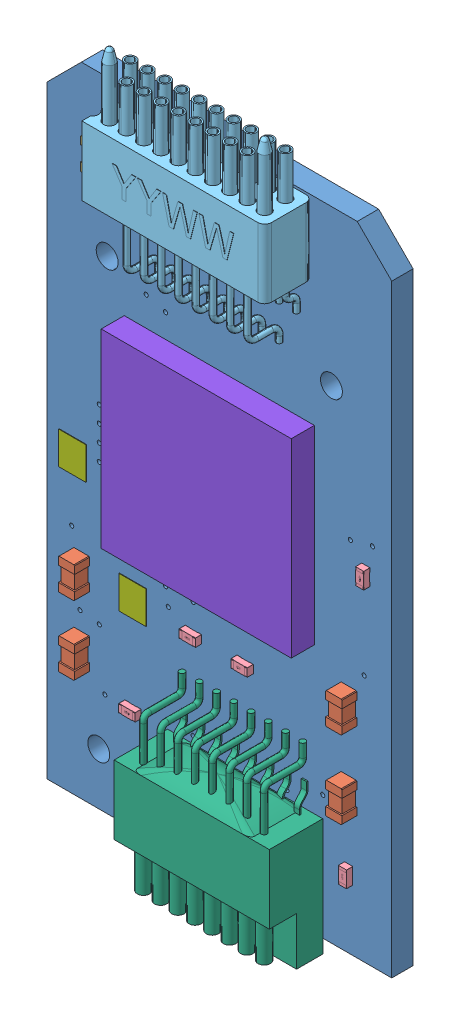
SolidWorks assembly RHS2116_16.SLDASM, configuration Default (file format 15000). Lengths in mm.
Overall size (12.7 26.28 2.85).
17 component instances, 8 part files, 22 mates.
Components (placement in the parent):
- RHS2116_16_PCB-1: RHS2116_16_PCB.SLDPRT [Default] at origin size (12.7 23.49 0.79)
- 0402c_2320560-1: 0402c_2320560.sldprt [Default] at (11.1125 5.08 0.7874) x (0 -1 0) z (0 0 1) size (1.15 0.6 0.55)
- 0402c_2320560-2: 0402c_2320560.sldprt [Default] at (1.27 4.7625 0.7874) x (0 1 0) z (0 0 1) size (1.15 0.6 0.55)
- 0402c_2320560-3: 0402c_2320560.sldprt [Default] at (1.27 7.3025 0.7874) x (0 -1 0) z (0 0 1) size (1.15 0.6 0.55)
- 0402c_2320560-4: 0402c_2320560.sldprt [Default] at (11.1125 7.9375 0.7874) x (0 -1 0) z (0 0 1) size (1.15 0.6 0.55)
- 0402r_1430758-1: 0402r_1430758.sldprt [Default] at (1.905 20.9675 0.7874) x (0 1 0) z (0 0 1) size (1.15 0.55 0.4)
- 0201r-1: 0201r.sldprt [0201] at (3.175 3.81 0.9024) x (0 1 0) z (1 0 0) size (0.3 0.23 0.6)
- 0201r-2: 0201r.sldprt [0201] at (5.3975 7.3025 0.9024) x (0 1 0) z (1 0 0) size (0.3 0.23 0.6)
- 0201r-3: 0201r.sldprt [0201] at (7.3025 7.3025 0.9024) x (0 1 0) z (1 0 0) size (0.3 0.23 0.6)
- 0201r-4: 0201r.sldprt [0201] at (11.1125 2.54 0.9024) x (1 0 0) z (0 -1 0) size (0.3 0.23 0.6)
- 0201r-5: 0201r.sldprt [0201] at (11.7475 12.3825 0.9024) x (-1 0 0) z (0 1 0) size (0.3 0.23 0.6)
- A79041-001-1: A79041-001.SLDPRT [Default] at (6.4328 22.1366 1.6764) x (-1 0 0) z (0 1 0) size (6.73 2.08 7.44)
- A79633-001-1: A79633-001.SLDPRT [Default] at (7.3025 3.81 0.7874) x (1 0 0) z (0 -1 0) size (5.72 2.06 6.53)
- smd_pad_1_0_x_1_2-1: smd_pad_1_0_x_1_2.SLDPRT [Default] at (0.9525 10.795 0.8074) x (0 -1 0) z (1 0 0) size (1.2 0.02 1)
- smd_pad_1_0_x_1_2-2: smd_pad_1_0_x_1_2.SLDPRT [Default] at (3.175 7.3025 0.7874) x (0 1 0) z (1 0 0) size (1.2 0.02 1)
- smd_pad_1_0_x_1_2-3: smd_pad_1_0_x_1_2.SLDPRT [Default] at (2.54 9.2075 -0.02) x (0 1 0) z (1 0 0) size (1.2 0.02 1)
- QFN_7x7mm-1: QFN_7x7mm.SLDPRT [Default] at (9.85 16.2 0.7874) x (-1 0 0) z (0 1 0) size (7 0.85 7)
Mates (geometry in assembly coordinates):
- Coincident1: coincident anti-aligned: plane of RHS2116_16-1 through (0 0 0.7874) normal (0 0 1); plane of QFN_7x7mm-1 through (9.85 16.2 0.7874) normal (0 0 -1)
- Parallel1: parallel aligned: plane of RHS2116_16-1 through (12.7 0 0.7874) normal (0 -1 0); plane of QFN_7x7mm-1 through (9.85 9.2 1.6374) normal (0 -1 0)
- Coincident3: coincident anti-aligned: plane of RHS2116_16-1 through (0 0 0.7874) normal (0 0 1); plane of A79633-001-1 through (7.3025 3.81 0.7874) normal (0 0 -1)
- Parallel2: parallel aligned: plane of RHS2116_16-1 through (12.7 0 0.7874) normal (0 -1 0); plane of A79633-001-1 through (7.3025 -0.508 0.7874) normal (0 -1 0)
- Coincident5: coincident anti-aligned: plane of RHS2116_16-1 through (0 0 0.7874) normal (0 0 1); plane of A79041-001-1 through (9.7983 20.8666 0.7874) normal (0 0 -1)
- Parallel3: parallel aligned: plane of RHS2116_16-1 through (1.27 23.495 0.7874) normal (0 1 0); plane of A79041-001-1 through (9.7983 23.4066 2.5654) normal (0 1 0)
- Coincident9: coincident anti-aligned: plane of RHS2116_16-1 through (0 0 0.7874) normal (0 0 1); plane of smd_pad_1_0_x_1_2-2 through (3.175 7.3025 0.7874) normal (0 0 -1)
- Parallel5: parallel aligned: plane of RHS2116_16-1 through (0 0 0.7874) normal (-1 0 0); plane of smd_pad_1_0_x_1_2-2 through (2.675 6.7025 0.8074) normal (-1 0 0)
- Coincident11: coincident anti-aligned: plane of RHS2116_16-1 through (0 0 0.7874) normal (0 0 1); plane of smd_pad_1_0_x_1_2-1 through (0.9525 10.795 0.7874) normal (0 0 -1)
- Parallel6: parallel aligned: plane of RHS2116_16-1 through (0 0 0.7874) normal (-1 0 0); plane of smd_pad_1_0_x_1_2-1 through (0.4525 11.395 0.7874) normal (-1 0 0)
- Coincident13: coincident anti-aligned: plane of RHS2116_16-1 through (0 0 0) normal (0 0 -1); plane of smd_pad_1_0_x_1_2-3 through (2.54 9.2075 0) normal (0 0 1)
- Parallel7: parallel aligned: plane of RHS2116_16-1 through (0 0 0.7874) normal (-1 0 0); plane of smd_pad_1_0_x_1_2-3 through (2.04 8.6075 0) normal (-1 0 0)
- Coincident15: coincident anti-aligned: plane of RHS2116_16-1 through (0 0 0.7874) normal (0 0 1); plane of 0201r-5 through (11.5975 12.6825 0.7874) normal (0 0 -1)
- Parallel8: parallel aligned: plane of RHS2116_16-1 through (12.7 22.225 0.7874) normal (1 0 0); plane of 0201r-5 through (11.8975 12.6825 1.0174) normal (1 0 0)
- Coincident16: coincident anti-aligned: plane of RHS2116_16-1 through (0 0 0.7874) normal (0 0 1); plane of 0201r-2 through (5.6975 7.4525 0.7874) normal (0 0 -1)
- Parallel9: parallel anti-aligned: plane of RHS2116_16-1 through (0 0 0.7874) normal (-1 0 0); plane of 0201r-2 through (5.6975 7.4525 1.0174) normal (1 0 0)
- Coincident18: coincident anti-aligned: plane of RHS2116_16-1 through (0 0 0.7874) normal (0 0 1); plane of 0201r-3 through (7.6025 7.4525 0.7874) normal (0 0 -1)
- Parallel10: parallel anti-aligned: plane of RHS2116_16-1 through (0 0 0.7874) normal (-1 0 0); plane of 0201r-3 through (7.6025 7.4525 1.0174) normal (1 0 0)
- Coincident20: coincident anti-aligned: plane of RHS2116_16-1 through (0 0 0.7874) normal (0 0 1); plane of 0201r-1 through (3.475 3.96 0.7874) normal (0 0 -1)
- Parallel11: parallel anti-aligned: plane of RHS2116_16-1 through (0 0 0.7874) normal (-1 0 0); plane of 0201r-1 through (3.475 3.96 1.0174) normal (1 0 0)
- Coincident22: coincident anti-aligned: plane of RHS2116_16-1 through (0 0 0.7874) normal (0 0 1); plane of 0201r-4 through (11.2625 2.24 0.7874) normal (0 0 -1)
- Parallel12: parallel anti-aligned: plane of RHS2116_16-1 through (12.7 0 0.7874) normal (0 -1 0); plane of 0201r-4 through (11.2625 2.84 1.0174) normal (0 1 0)
